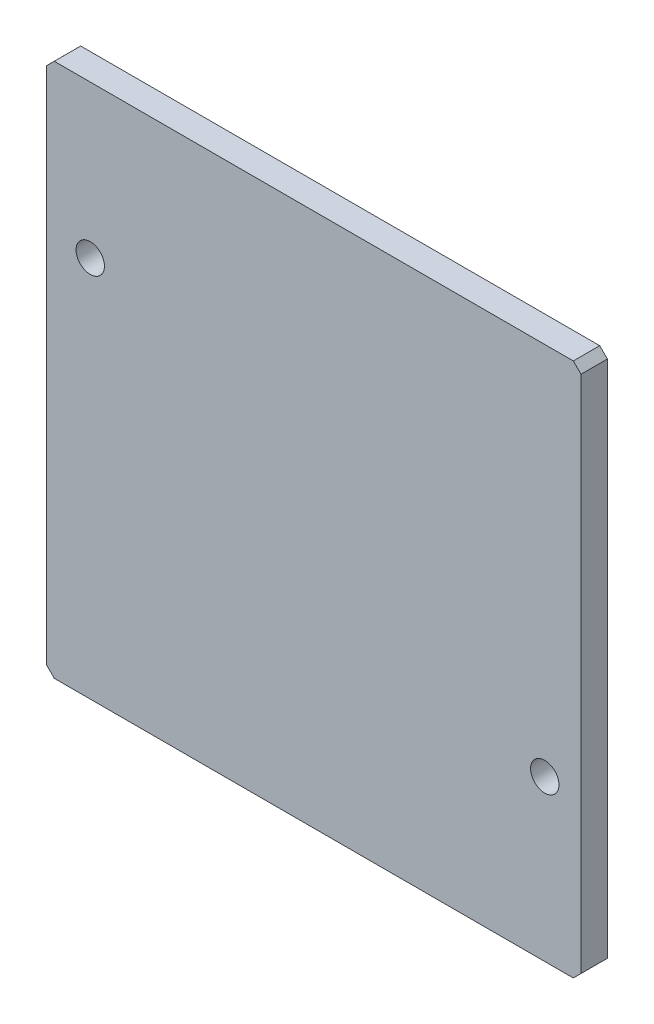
ISO-10303-21;
HEADER;
FILE_DESCRIPTION(('STEP AP214'),'2;1');
FILE_NAME('part.step','',(''),(''),'','','');
FILE_SCHEMA(('AUTOMOTIVE_DESIGN { 1 0 10303 214 1 1 1 1 }'));
ENDSEC;
DATA;
#1=APPLICATION_CONTEXT('core data for automotive mechanical design processes');
#2=APPLICATION_PROTOCOL_DEFINITION('international standard','automotive_design',2000,#1);
#3=PRODUCT_CONTEXT('',#1,'mechanical');
#4=PRODUCT('Part','Part','',(#3));
#5=PRODUCT_RELATED_PRODUCT_CATEGORY('part','',(#4));
#6=PRODUCT_DEFINITION_FORMATION('','',#4);
#7=PRODUCT_DEFINITION_CONTEXT('part definition',#1,'design');
#8=PRODUCT_DEFINITION('design','',#6,#7);
#9=PRODUCT_DEFINITION_SHAPE('','',#8);
#10=(LENGTH_UNIT() NAMED_UNIT(*) SI_UNIT(.MILLI.,.METRE.));
#11=(NAMED_UNIT(*) PLANE_ANGLE_UNIT() SI_UNIT($,.RADIAN.));
#12=(NAMED_UNIT(*) SI_UNIT($,.STERADIAN.) SOLID_ANGLE_UNIT());
#13=UNCERTAINTY_MEASURE_WITH_UNIT(LENGTH_MEASURE(1.E-05),#10,'distance_accuracy_value','');
#14=(GEOMETRIC_REPRESENTATION_CONTEXT(3) GLOBAL_UNCERTAINTY_ASSIGNED_CONTEXT((#13)) GLOBAL_UNIT_ASSIGNED_CONTEXT((#10,
#11,#12)) REPRESENTATION_CONTEXT('',''));
#15=CARTESIAN_POINT('',(0.,0.,0.));
#16=DIRECTION('',(0.,0.,1.));
#17=DIRECTION('',(1.,0.,0.));
#18=AXIS2_PLACEMENT_3D('',#15,#16,#17);
#19=CARTESIAN_POINT('',(13.384811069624,-6.873812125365,1.58200852));
#20=DIRECTION('',(0.,0.,-1.));
#21=DIRECTION('',(0.,-1.,0.));
#22=AXIS2_PLACEMENT_3D('',#19,#20,#21);
#23=PLANE('',#22);
#24=CARTESIAN_POINT('',(27.216,-13.29,1.58200852));
#25=DIRECTION('',(0.,0.,1.));
#26=DIRECTION('',(1.,0.,0.));
#27=AXIS2_PLACEMENT_3D('',#24,#25,#26);
#28=CIRCLE('',#27,0.85);
#29=CARTESIAN_POINT('',(28.066,-13.29,1.58200852));
#30=VERTEX_POINT('',#29);
#31=EDGE_CURVE('E25',#30,#30,#28,.T.);
#32=ORIENTED_EDGE('',*,*,#31,.F.);
#33=EDGE_LOOP('',(#32));
#34=FACE_BOUND('',#33,.T.);
#35=CARTESIAN_POINT('',(0.,0.,1.58200852));
#36=DIRECTION('',(0.,0.,1.));
#37=DIRECTION('',(1.,0.,0.));
#38=AXIS2_PLACEMENT_3D('',#35,#36,#37);
#39=CIRCLE('',#38,0.85);
#40=CARTESIAN_POINT('',(0.85,0.,1.58200852));
#41=VERTEX_POINT('',#40);
#42=EDGE_CURVE('E198',#41,#41,#39,.T.);
#43=ORIENTED_EDGE('',*,*,#42,.F.);
#44=EDGE_LOOP('',(#43));
#45=FACE_BOUND('',#44,.T.);
#46=DIRECTION('',(-0.707106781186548,0.707106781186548,0.));
#47=VECTOR('',#46,1.);
#48=CARTESIAN_POINT('',(-2.155,-22.874,1.58200852));
#49=LINE('',#48,#47);
#50=CARTESIAN_POINT('',(-2.155,-22.874,1.58200852));
#51=VERTEX_POINT('',#50);
#52=CARTESIAN_POINT('',(-2.615,-22.414,1.58200852));
#53=VERTEX_POINT('',#52);
#54=EDGE_CURVE('E117',#51,#53,#49,.T.);
#55=ORIENTED_EDGE('',*,*,#54,.F.);
#56=DIRECTION('',(-1.,0.,0.));
#57=VECTOR('',#56,1.);
#58=CARTESIAN_POINT('',(28.925,-22.874,1.58200852));
#59=LINE('',#58,#57);
#60=CARTESIAN_POINT('',(28.925,-22.874,1.58200852));
#61=VERTEX_POINT('',#60);
#62=EDGE_CURVE('E220',#61,#51,#59,.T.);
#63=ORIENTED_EDGE('',*,*,#62,.F.);
#64=DIRECTION('',(-0.707106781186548,-0.707106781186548,0.));
#65=VECTOR('',#64,1.);
#66=CARTESIAN_POINT('',(29.385,-22.414,1.58200852));
#67=LINE('',#66,#65);
#68=CARTESIAN_POINT('',(29.385,-22.414,1.58200852));
#69=VERTEX_POINT('',#68);
#70=EDGE_CURVE('E208',#69,#61,#67,.T.);
#71=ORIENTED_EDGE('',*,*,#70,.F.);
#72=DIRECTION('',(0.,-1.,0.));
#73=VECTOR('',#72,1.);
#74=CARTESIAN_POINT('',(29.385,8.666,1.58200852));
#75=LINE('',#74,#73);
#76=CARTESIAN_POINT('',(29.385,8.666,1.58200852));
#77=VERTEX_POINT('',#76);
#78=EDGE_CURVE('E168',#77,#69,#75,.T.);
#79=ORIENTED_EDGE('',*,*,#78,.F.);
#80=DIRECTION('',(0.707106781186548,-0.707106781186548,0.));
#81=VECTOR('',#80,1.);
#82=CARTESIAN_POINT('',(28.925,9.126,1.58200852));
#83=LINE('',#82,#81);
#84=CARTESIAN_POINT('',(28.925,9.126,1.58200852));
#85=VERTEX_POINT('',#84);
#86=EDGE_CURVE('E155',#85,#77,#83,.T.);
#87=ORIENTED_EDGE('',*,*,#86,.F.);
#88=DIRECTION('',(1.,0.,0.));
#89=VECTOR('',#88,1.);
#90=CARTESIAN_POINT('',(-2.157,9.126,1.58200852));
#91=LINE('',#90,#89);
#92=CARTESIAN_POINT('',(-2.157,9.126,1.58200852));
#93=VERTEX_POINT('',#92);
#94=EDGE_CURVE('E179',#93,#85,#91,.T.);
#95=ORIENTED_EDGE('',*,*,#94,.F.);
#96=DIRECTION('',(0.70787915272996,0.706333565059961,0.));
#97=VECTOR('',#96,1.);
#98=CARTESIAN_POINT('',(-2.615,8.669,1.58200852));
#99=LINE('',#98,#97);
#100=CARTESIAN_POINT('',(-2.615,8.669,1.58200852));
#101=VERTEX_POINT('',#100);
#102=EDGE_CURVE('E133',#101,#93,#99,.T.);
#103=ORIENTED_EDGE('',*,*,#102,.F.);
#104=DIRECTION('',(0.,1.,0.));
#105=VECTOR('',#104,1.);
#106=CARTESIAN_POINT('',(-2.615,-22.414,1.58200852));
#107=LINE('',#106,#105);
#108=EDGE_CURVE('E131',#53,#101,#107,.T.);
#109=ORIENTED_EDGE('',*,*,#108,.F.);
#110=EDGE_LOOP('',(#55,#63,#71,#79,#87,#95,#103,#109));
#111=FACE_BOUND('',#110,.T.);
#112=ADVANCED_FACE('F17',(#34,#45,#111),#23,.F.);
#113=CARTESIAN_POINT('',(13.384811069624,-6.873812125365,0.));
#114=DIRECTION('',(0.,0.,-1.));
#115=DIRECTION('',(0.,-1.,0.));
#116=AXIS2_PLACEMENT_3D('',#113,#114,#115);
#117=PLANE('',#116);
#118=CARTESIAN_POINT('',(27.216,-13.29,0.));
#119=DIRECTION('',(0.,0.,1.));
#120=DIRECTION('',(1.,0.,0.));
#121=AXIS2_PLACEMENT_3D('',#118,#119,#120);
#122=CIRCLE('',#121,0.85);
#123=CARTESIAN_POINT('',(28.066,-13.29,0.));
#124=VERTEX_POINT('',#123);
#125=EDGE_CURVE('E11',#124,#124,#122,.T.);
#126=ORIENTED_EDGE('',*,*,#125,.T.);
#127=EDGE_LOOP('',(#126));
#128=FACE_BOUND('',#127,.T.);
#129=CARTESIAN_POINT('',(0.,0.,0.));
#130=DIRECTION('',(0.,0.,1.));
#131=DIRECTION('',(1.,0.,0.));
#132=AXIS2_PLACEMENT_3D('',#129,#130,#131);
#133=CIRCLE('',#132,0.85);
#134=CARTESIAN_POINT('',(0.85,0.,0.));
#135=VERTEX_POINT('',#134);
#136=EDGE_CURVE('E229',#135,#135,#133,.T.);
#137=ORIENTED_EDGE('',*,*,#136,.T.);
#138=EDGE_LOOP('',(#137));
#139=FACE_BOUND('',#138,.T.);
#140=DIRECTION('',(0.,1.,0.));
#141=VECTOR('',#140,1.);
#142=CARTESIAN_POINT('',(-2.615,-22.414,0.));
#143=LINE('',#142,#141);
#144=CARTESIAN_POINT('',(-2.615,-22.414,0.));
#145=VERTEX_POINT('',#144);
#146=CARTESIAN_POINT('',(-2.615,8.669,0.));
#147=VERTEX_POINT('',#146);
#148=EDGE_CURVE('E143',#145,#147,#143,.T.);
#149=ORIENTED_EDGE('',*,*,#148,.T.);
#150=DIRECTION('',(0.70787915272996,0.706333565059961,0.));
#151=VECTOR('',#150,1.);
#152=CARTESIAN_POINT('',(-2.615,8.669,0.));
#153=LINE('',#152,#151);
#154=CARTESIAN_POINT('',(-2.157,9.126,0.));
#155=VERTEX_POINT('',#154);
#156=EDGE_CURVE('E173',#147,#155,#153,.T.);
#157=ORIENTED_EDGE('',*,*,#156,.T.);
#158=DIRECTION('',(1.,0.,0.));
#159=VECTOR('',#158,1.);
#160=CARTESIAN_POINT('',(-2.157,9.126,0.));
#161=LINE('',#160,#159);
#162=CARTESIAN_POINT('',(28.925,9.126,0.));
#163=VERTEX_POINT('',#162);
#164=EDGE_CURVE('E190',#155,#163,#161,.T.);
#165=ORIENTED_EDGE('',*,*,#164,.T.);
#166=DIRECTION('',(0.707106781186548,-0.707106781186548,0.));
#167=VECTOR('',#166,1.);
#168=CARTESIAN_POINT('',(28.925,9.126,0.));
#169=LINE('',#168,#167);
#170=CARTESIAN_POINT('',(29.385,8.666,0.));
#171=VERTEX_POINT('',#170);
#172=EDGE_CURVE('E154',#163,#171,#169,.T.);
#173=ORIENTED_EDGE('',*,*,#172,.T.);
#174=DIRECTION('',(0.,-1.,0.));
#175=VECTOR('',#174,1.);
#176=CARTESIAN_POINT('',(29.385,8.666,0.));
#177=LINE('',#176,#175);
#178=CARTESIAN_POINT('',(29.385,-22.414,0.));
#179=VERTEX_POINT('',#178);
#180=EDGE_CURVE('E167',#171,#179,#177,.T.);
#181=ORIENTED_EDGE('',*,*,#180,.T.);
#182=DIRECTION('',(-0.707106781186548,-0.707106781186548,0.));
#183=VECTOR('',#182,1.);
#184=CARTESIAN_POINT('',(29.385,-22.414,0.));
#185=LINE('',#184,#183);
#186=CARTESIAN_POINT('',(28.925,-22.874,0.));
#187=VERTEX_POINT('',#186);
#188=EDGE_CURVE('E216',#179,#187,#185,.T.);
#189=ORIENTED_EDGE('',*,*,#188,.T.);
#190=DIRECTION('',(-1.,0.,0.));
#191=VECTOR('',#190,1.);
#192=CARTESIAN_POINT('',(28.925,-22.874,0.));
#193=LINE('',#192,#191);
#194=CARTESIAN_POINT('',(-2.155,-22.874,0.));
#195=VERTEX_POINT('',#194);
#196=EDGE_CURVE('E128',#187,#195,#193,.T.);
#197=ORIENTED_EDGE('',*,*,#196,.T.);
#198=DIRECTION('',(-0.707106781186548,0.707106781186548,0.));
#199=VECTOR('',#198,1.);
#200=CARTESIAN_POINT('',(-2.155,-22.874,0.));
#201=LINE('',#200,#199);
#202=EDGE_CURVE('E127',#195,#145,#201,.T.);
#203=ORIENTED_EDGE('',*,*,#202,.T.);
#204=EDGE_LOOP('',(#149,#157,#165,#173,#181,#189,#197,#203));
#205=FACE_BOUND('',#204,.T.);
#206=ADVANCED_FACE('F420',(#128,#139,#205),#117,.T.);
#207=CARTESIAN_POINT('',(27.216,-13.29,0.));
#208=DIRECTION('',(0.,0.,-1.));
#209=DIRECTION('',(1.,0.,0.));
#210=AXIS2_PLACEMENT_3D('',#207,#208,#209);
#211=CYLINDRICAL_SURFACE('',#210,0.85);
#212=DIRECTION('',(0.,0.,1.));
#213=VECTOR('',#212,1.);
#214=CARTESIAN_POINT('',(28.066,-13.29,0.));
#215=LINE('',#214,#213);
#216=EDGE_CURVE('E232',#124,#30,#215,.T.);
#217=ORIENTED_EDGE('',*,*,#216,.T.);
#218=ORIENTED_EDGE('',*,*,#31,.T.);
#219=ORIENTED_EDGE('',*,*,#216,.F.);
#220=ORIENTED_EDGE('',*,*,#125,.F.);
#221=EDGE_LOOP('',(#217,#218,#219,#220));
#222=FACE_BOUND('',#221,.T.);
#223=ADVANCED_FACE('F410',(#222),#211,.F.);
#224=CARTESIAN_POINT('',(0.,0.,0.));
#225=DIRECTION('',(0.,0.,-1.));
#226=DIRECTION('',(1.,0.,0.));
#227=AXIS2_PLACEMENT_3D('',#224,#225,#226);
#228=CYLINDRICAL_SURFACE('',#227,0.85);
#229=DIRECTION('',(0.,0.,1.));
#230=VECTOR('',#229,1.);
#231=CARTESIAN_POINT('',(0.85,0.,0.));
#232=LINE('',#231,#230);
#233=EDGE_CURVE('E194',#135,#41,#232,.T.);
#234=ORIENTED_EDGE('',*,*,#233,.T.);
#235=ORIENTED_EDGE('',*,*,#42,.T.);
#236=ORIENTED_EDGE('',*,*,#233,.F.);
#237=ORIENTED_EDGE('',*,*,#136,.F.);
#238=EDGE_LOOP('',(#234,#235,#236,#237));
#239=FACE_BOUND('',#238,.T.);
#240=ADVANCED_FACE('F403',(#239),#228,.F.);
#241=CARTESIAN_POINT('',(-2.155,-22.874,0.));
#242=DIRECTION('',(-0.707106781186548,-0.707106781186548,0.));
#243=DIRECTION('',(-0.707106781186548,0.707106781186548,0.));
#244=AXIS2_PLACEMENT_3D('',#241,#242,#243);
#245=PLANE('',#244);
#246=DIRECTION('',(0.,0.,1.));
#247=VECTOR('',#246,1.);
#248=CARTESIAN_POINT('',(-2.155,-22.874,0.));
#249=LINE('',#248,#247);
#250=EDGE_CURVE('E123',#195,#51,#249,.T.);
#251=ORIENTED_EDGE('',*,*,#250,.T.);
#252=ORIENTED_EDGE('',*,*,#54,.T.);
#253=DIRECTION('',(0.,0.,1.));
#254=VECTOR('',#253,1.);
#255=CARTESIAN_POINT('',(-2.615,-22.414,0.));
#256=LINE('',#255,#254);
#257=EDGE_CURVE('E121',#145,#53,#256,.T.);
#258=ORIENTED_EDGE('',*,*,#257,.F.);
#259=ORIENTED_EDGE('',*,*,#202,.F.);
#260=EDGE_LOOP('',(#251,#252,#258,#259));
#261=FACE_BOUND('',#260,.T.);
#262=ADVANCED_FACE('F119',(#261),#245,.T.);
#263=CARTESIAN_POINT('',(28.925,-22.874,0.));
#264=DIRECTION('',(0.,-1.,0.));
#265=DIRECTION('',(0.,0.,-1.));
#266=AXIS2_PLACEMENT_3D('',#263,#264,#265);
#267=PLANE('',#266);
#268=DIRECTION('',(0.,0.,1.));
#269=VECTOR('',#268,1.);
#270=CARTESIAN_POINT('',(28.925,-22.874,0.));
#271=LINE('',#270,#269);
#272=EDGE_CURVE('E212',#187,#61,#271,.T.);
#273=ORIENTED_EDGE('',*,*,#272,.T.);
#274=ORIENTED_EDGE('',*,*,#62,.T.);
#275=ORIENTED_EDGE('',*,*,#250,.F.);
#276=ORIENTED_EDGE('',*,*,#196,.F.);
#277=EDGE_LOOP('',(#273,#274,#275,#276));
#278=FACE_BOUND('',#277,.T.);
#279=ADVANCED_FACE('F384',(#278),#267,.T.);
#280=CARTESIAN_POINT('',(29.385,-22.414,0.));
#281=DIRECTION('',(0.707106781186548,-0.707106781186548,0.));
#282=DIRECTION('',(0.,0.,-1.));
#283=AXIS2_PLACEMENT_3D('',#280,#281,#282);
#284=PLANE('',#283);
#285=DIRECTION('',(0.,0.,1.));
#286=VECTOR('',#285,1.);
#287=CARTESIAN_POINT('',(29.385,-22.414,0.));
#288=LINE('',#287,#286);
#289=EDGE_CURVE('E163',#179,#69,#288,.T.);
#290=ORIENTED_EDGE('',*,*,#289,.T.);
#291=ORIENTED_EDGE('',*,*,#70,.T.);
#292=ORIENTED_EDGE('',*,*,#272,.F.);
#293=ORIENTED_EDGE('',*,*,#188,.F.);
#294=EDGE_LOOP('',(#290,#291,#292,#293));
#295=FACE_BOUND('',#294,.T.);
#296=ADVANCED_FACE('F374',(#295),#284,.T.);
#297=CARTESIAN_POINT('',(29.385,8.666,0.));
#298=DIRECTION('',(1.,0.,0.));
#299=DIRECTION('',(0.,1.,0.));
#300=AXIS2_PLACEMENT_3D('',#297,#298,#299);
#301=PLANE('',#300);
#302=DIRECTION('',(0.,0.,1.));
#303=VECTOR('',#302,1.);
#304=CARTESIAN_POINT('',(29.385,8.666,0.));
#305=LINE('',#304,#303);
#306=EDGE_CURVE('E150',#171,#77,#305,.T.);
#307=ORIENTED_EDGE('',*,*,#306,.T.);
#308=ORIENTED_EDGE('',*,*,#78,.T.);
#309=ORIENTED_EDGE('',*,*,#289,.F.);
#310=ORIENTED_EDGE('',*,*,#180,.F.);
#311=EDGE_LOOP('',(#307,#308,#309,#310));
#312=FACE_BOUND('',#311,.T.);
#313=ADVANCED_FACE('F364',(#312),#301,.T.);
#314=CARTESIAN_POINT('',(28.925,9.126,0.));
#315=DIRECTION('',(0.707106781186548,0.707106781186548,0.));
#316=DIRECTION('',(0.,0.,-1.));
#317=AXIS2_PLACEMENT_3D('',#314,#315,#316);
#318=PLANE('',#317);
#319=DIRECTION('',(0.,0.,1.));
#320=VECTOR('',#319,1.);
#321=CARTESIAN_POINT('',(28.925,9.126,0.));
#322=LINE('',#321,#320);
#323=EDGE_CURVE('E186',#163,#85,#322,.T.);
#324=ORIENTED_EDGE('',*,*,#323,.T.);
#325=ORIENTED_EDGE('',*,*,#86,.T.);
#326=ORIENTED_EDGE('',*,*,#306,.F.);
#327=ORIENTED_EDGE('',*,*,#172,.F.);
#328=EDGE_LOOP('',(#324,#325,#326,#327));
#329=FACE_BOUND('',#328,.T.);
#330=ADVANCED_FACE('F354',(#329),#318,.T.);
#331=CARTESIAN_POINT('',(-2.157,9.126,0.));
#332=DIRECTION('',(0.,1.,0.));
#333=DIRECTION('',(1.,0.,0.));
#334=AXIS2_PLACEMENT_3D('',#331,#332,#333);
#335=PLANE('',#334);
#336=DIRECTION('',(0.,0.,1.));
#337=VECTOR('',#336,1.);
#338=CARTESIAN_POINT('',(-2.157,9.126,0.));
#339=LINE('',#338,#337);
#340=EDGE_CURVE('E169',#155,#93,#339,.T.);
#341=ORIENTED_EDGE('',*,*,#340,.T.);
#342=ORIENTED_EDGE('',*,*,#94,.T.);
#343=ORIENTED_EDGE('',*,*,#323,.F.);
#344=ORIENTED_EDGE('',*,*,#164,.F.);
#345=EDGE_LOOP('',(#341,#342,#343,#344));
#346=FACE_BOUND('',#345,.T.);
#347=ADVANCED_FACE('F343',(#346),#335,.T.);
#348=CARTESIAN_POINT('',(-2.615,8.669,0.));
#349=DIRECTION('',(-0.706333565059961,0.70787915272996,0.));
#350=DIRECTION('',(0.,0.,1.));
#351=AXIS2_PLACEMENT_3D('',#348,#349,#350);
#352=PLANE('',#351);
#353=DIRECTION('',(0.,0.,1.));
#354=VECTOR('',#353,1.);
#355=CARTESIAN_POINT('',(-2.615,8.669,0.));
#356=LINE('',#355,#354);
#357=EDGE_CURVE('E138',#147,#101,#356,.T.);
#358=ORIENTED_EDGE('',*,*,#357,.T.);
#359=ORIENTED_EDGE('',*,*,#102,.T.);
#360=ORIENTED_EDGE('',*,*,#340,.F.);
#361=ORIENTED_EDGE('',*,*,#156,.F.);
#362=EDGE_LOOP('',(#358,#359,#360,#361));
#363=FACE_BOUND('',#362,.T.);
#364=ADVANCED_FACE('F332',(#363),#352,.T.);
#365=CARTESIAN_POINT('',(-2.615,-22.414,0.));
#366=DIRECTION('',(-1.,0.,0.));
#367=DIRECTION('',(0.,0.,1.));
#368=AXIS2_PLACEMENT_3D('',#365,#366,#367);
#369=PLANE('',#368);
#370=ORIENTED_EDGE('',*,*,#257,.T.);
#371=ORIENTED_EDGE('',*,*,#108,.T.);
#372=ORIENTED_EDGE('',*,*,#357,.F.);
#373=ORIENTED_EDGE('',*,*,#148,.F.);
#374=EDGE_LOOP('',(#370,#371,#372,#373));
#375=FACE_BOUND('',#374,.T.);
#376=ADVANCED_FACE('F141',(#375),#369,.T.);
#377=CLOSED_SHELL('',(#112,#206,#223,#240,#262,#279,#296,#313,#330,#347,#364,#376));
#378=MANIFOLD_SOLID_BREP('B1',#377);
#379=ADVANCED_BREP_SHAPE_REPRESENTATION('',(#18,#378),#14);
#380=SHAPE_DEFINITION_REPRESENTATION(#9,#379);
ENDSEC;
END-ISO-10303-21;
